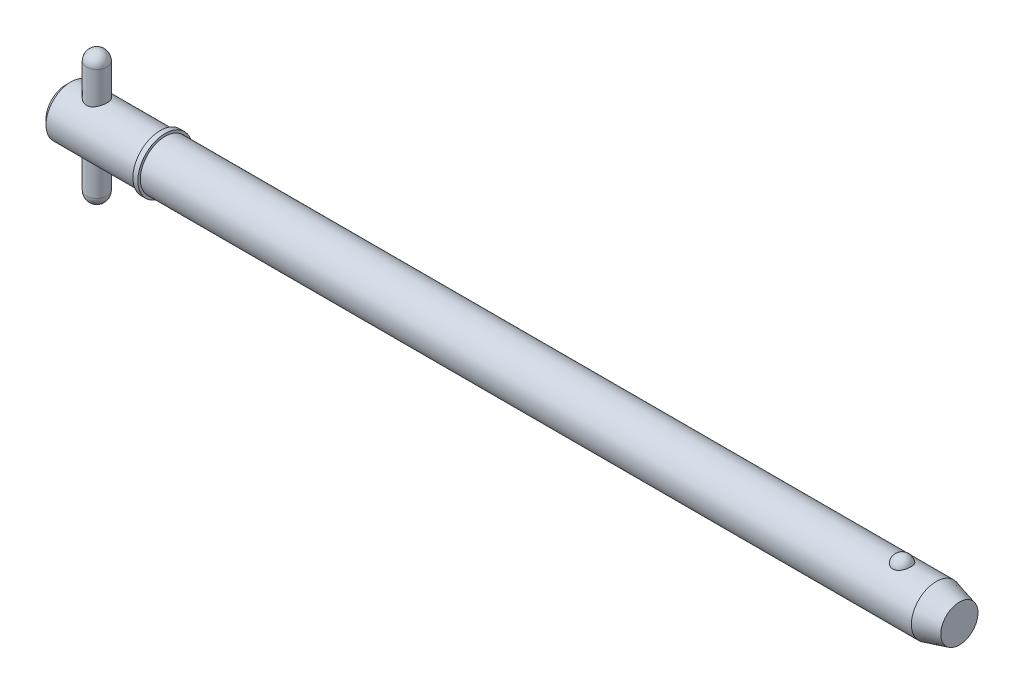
ISO-10303-21;
HEADER;
FILE_DESCRIPTION(('STEP AP214'),'2;1');
FILE_NAME('part.step','',(''),(''),'','','');
FILE_SCHEMA(('AUTOMOTIVE_DESIGN { 1 0 10303 214 1 1 1 1 }'));
ENDSEC;
DATA;
#1=APPLICATION_CONTEXT('core data for automotive mechanical design processes');
#2=APPLICATION_PROTOCOL_DEFINITION('international standard','automotive_design',2000,#1);
#3=PRODUCT_CONTEXT('',#1,'mechanical');
#4=PRODUCT('Part','Part','',(#3));
#5=PRODUCT_RELATED_PRODUCT_CATEGORY('part','',(#4));
#6=PRODUCT_DEFINITION_FORMATION('','',#4);
#7=PRODUCT_DEFINITION_CONTEXT('part definition',#1,'design');
#8=PRODUCT_DEFINITION('design','',#6,#7);
#9=PRODUCT_DEFINITION_SHAPE('','',#8);
#10=(LENGTH_UNIT() NAMED_UNIT(*) SI_UNIT(.MILLI.,.METRE.));
#11=(NAMED_UNIT(*) PLANE_ANGLE_UNIT() SI_UNIT($,.RADIAN.));
#12=(NAMED_UNIT(*) SI_UNIT($,.STERADIAN.) SOLID_ANGLE_UNIT());
#13=UNCERTAINTY_MEASURE_WITH_UNIT(LENGTH_MEASURE(1.E-05),#10,'distance_accuracy_value','');
#14=(GEOMETRIC_REPRESENTATION_CONTEXT(3) GLOBAL_UNCERTAINTY_ASSIGNED_CONTEXT((#13)) GLOBAL_UNIT_ASSIGNED_CONTEXT((#10,
#11,#12)) REPRESENTATION_CONTEXT('',''));
#15=CARTESIAN_POINT('',(0.,0.,0.));
#16=DIRECTION('',(0.,0.,1.));
#17=DIRECTION('',(1.,0.,0.));
#18=AXIS2_PLACEMENT_3D('',#15,#16,#17);
#19=CARTESIAN_POINT('',(5.94,12.7,0.));
#20=DIRECTION('',(0.,-1.,0.));
#21=DIRECTION('',(0.,0.,-1.));
#22=AXIS2_PLACEMENT_3D('',#19,#20,#21);
#23=CYLINDRICAL_SURFACE('',#22,1.98);
#24=CARTESIAN_POINT('',(5.94,-10.72,0.));
#25=DIRECTION('',(0.,-1.,0.));
#26=DIRECTION('',(0.,0.,-1.));
#27=AXIS2_PLACEMENT_3D('',#24,#25,#26);
#28=CIRCLE('',#27,1.98);
#29=CARTESIAN_POINT('',(5.94,-10.72,-1.98));
#30=VERTEX_POINT('',#29);
#31=EDGE_CURVE('P0_E10',#30,#30,#28,.F.);
#32=ORIENTED_EDGE('',*,*,#31,.T.);
#33=EDGE_LOOP('',(#32));
#34=FACE_BOUND('',#33,.T.);
#35=CARTESIAN_POINT('',(5.94,10.72,0.));
#36=DIRECTION('',(0.,-1.,0.));
#37=DIRECTION('',(0.,0.,-1.));
#38=AXIS2_PLACEMENT_3D('',#35,#36,#37);
#39=CIRCLE('',#38,1.98);
#40=CARTESIAN_POINT('',(5.94,10.72,-1.98));
#41=VERTEX_POINT('',#40);
#42=EDGE_CURVE('P0_E21',#41,#41,#39,.T.);
#43=ORIENTED_EDGE('',*,*,#42,.T.);
#44=EDGE_LOOP('',(#43));
#45=FACE_BOUND('',#44,.T.);
#46=ADVANCED_FACE('P0_F14',(#34,#45),#23,.T.);
#47=CARTESIAN_POINT('',(5.94,-10.72,0.));
#48=DIRECTION('',(0.,0.,1.));
#49=DIRECTION('',(1.,0.,0.));
#50=AXIS2_PLACEMENT_3D('',#47,#48,#49);
#51=SPHERICAL_SURFACE('',#50,1.98);
#52=CARTESIAN_POINT('',(5.94,-10.72,0.));
#53=DIRECTION('',(0.,-1.,0.));
#54=DIRECTION('',(0.,0.,-1.));
#55=AXIS2_PLACEMENT_3D('',#52,#53,#54);
#56=SPHERICAL_SURFACE('',#55,1.98);
#57=ORIENTED_EDGE('',*,*,#31,.F.);
#58=EDGE_LOOP('',(#57));
#59=FACE_BOUND('',#58,.T.);
#60=ADVANCED_FACE('P0_F29',(#59),#56,.T.);
#61=CARTESIAN_POINT('',(5.94,10.72,0.));
#62=DIRECTION('',(0.,0.,1.));
#63=DIRECTION('',(1.,0.,0.));
#64=AXIS2_PLACEMENT_3D('',#61,#62,#63);
#65=SPHERICAL_SURFACE('',#64,1.98);
#66=CARTESIAN_POINT('',(5.94,10.72,0.));
#67=DIRECTION('',(0.,-1.,0.));
#68=DIRECTION('',(0.,0.,-1.));
#69=AXIS2_PLACEMENT_3D('',#66,#67,#68);
#70=SPHERICAL_SURFACE('',#69,1.98);
#71=ORIENTED_EDGE('',*,*,#42,.F.);
#72=EDGE_LOOP('',(#71));
#73=FACE_BOUND('',#72,.T.);
#74=ADVANCED_FACE('P0_F16',(#73),#70,.T.);
#75=CLOSED_SHELL('',(#46,#60,#74));
#76=MANIFOLD_SOLID_BREP('P0_B1',#75);
#77=CARTESIAN_POINT('',(0.,0.,0.));
#78=DIRECTION('',(1.,0.,0.));
#79=DIRECTION('',(0.,0.,-1.));
#80=AXIS2_PLACEMENT_3D('',#77,#78,#79);
#81=CYLINDRICAL_SURFACE('',#80,4.765);
#82=CARTESIAN_POINT('',(167.004194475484,0.,0.));
#83=DIRECTION('',(1.,0.,0.));
#84=DIRECTION('',(0.,0.,-1.));
#85=AXIS2_PLACEMENT_3D('',#82,#83,#84);
#86=CIRCLE('',#85,4.765);
#87=CARTESIAN_POINT('',(167.004194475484,0.,-4.765));
#88=VERTEX_POINT('',#87);
#89=EDGE_CURVE('P1_E81',#88,#88,#86,.T.);
#90=ORIENTED_EDGE('',*,*,#89,.F.);
#91=EDGE_LOOP('',(#90));
#92=FACE_BOUND('',#91,.T.);
#93=CARTESIAN_POINT('',(19.05,0.,0.));
#94=DIRECTION('',(1.,0.,0.));
#95=DIRECTION('',(0.,0.,-1.));
#96=AXIS2_PLACEMENT_3D('',#93,#94,#95);
#97=CIRCLE('',#96,4.765);
#98=CARTESIAN_POINT('',(19.05,0.,-4.765));
#99=VERTEX_POINT('',#98);
#100=EDGE_CURVE('P1_E85',#99,#99,#97,.T.);
#101=ORIENTED_EDGE('',*,*,#100,.T.);
#102=EDGE_LOOP('',(#101));
#103=FACE_BOUND('',#102,.T.);
#104=CARTESIAN_POINT('',(160.451020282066,4.42764777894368,1.76101111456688));
#105=CARTESIAN_POINT('',(160.359721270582,4.42764470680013,1.76101422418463));
#106=CARTESIAN_POINT('',(160.268446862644,4.43059091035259,1.75366340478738));
#107=CARTESIAN_POINT('',(160.088615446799,4.44201846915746,1.72451180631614));
#108=CARTESIAN_POINT('',(160.000057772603,4.45049845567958,1.70271460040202));
#109=CARTESIAN_POINT('',(159.828257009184,4.47200516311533,1.64539370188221));
#110=CARTESIAN_POINT('',(159.745006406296,4.48502527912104,1.60988994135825));
#111=CARTESIAN_POINT('',(159.585763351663,4.51419542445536,1.52617873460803));
#112=CARTESIAN_POINT('',(159.509772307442,4.53034605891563,1.47796883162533));
#113=CARTESIAN_POINT('',(159.364744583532,4.56459317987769,1.36860494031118));
#114=CARTESIAN_POINT('',(159.295964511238,4.58273170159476,1.30712420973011));
#115=CARTESIAN_POINT('',(159.169342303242,4.61870302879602,1.17370204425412));
#116=CARTESIAN_POINT('',(159.111502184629,4.63653577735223,1.10175868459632));
#117=CARTESIAN_POINT('',(159.005570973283,4.67090140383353,0.945806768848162));
#118=CARTESIAN_POINT('',(158.958030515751,4.68734068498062,0.861402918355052));
#119=CARTESIAN_POINT('',(158.877081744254,4.71628466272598,0.685442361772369));
#120=CARTESIAN_POINT('',(158.843674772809,4.72878898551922,0.593884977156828));
#121=CARTESIAN_POINT('',(158.791287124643,4.74874061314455,0.404781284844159));
#122=CARTESIAN_POINT('',(158.772517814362,4.75611366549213,0.307168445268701));
#123=CARTESIAN_POINT('',(158.750584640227,4.76475393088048,0.109940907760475));
#124=CARTESIAN_POINT('',(158.747420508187,4.76602124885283,0.0103262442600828));
#125=CARTESIAN_POINT('',(158.756740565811,4.76232928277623,-0.187629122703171));
#126=CARTESIAN_POINT('',(158.769158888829,4.7573962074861,-0.285973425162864));
#127=CARTESIAN_POINT('',(158.809280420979,4.74184975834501,-0.479027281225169));
#128=CARTESIAN_POINT('',(158.836983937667,4.7312362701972,-0.573736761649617));
#129=CARTESIAN_POINT('',(158.907158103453,4.70540026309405,-0.756973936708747));
#130=CARTESIAN_POINT('',(158.949646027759,4.69017235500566,-0.845494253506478));
#131=CARTESIAN_POINT('',(159.048520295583,4.65669867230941,-1.01378033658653));
#132=CARTESIAN_POINT('',(159.104907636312,4.63845268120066,-1.09354547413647));
#133=CARTESIAN_POINT('',(159.230552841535,4.60085438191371,-1.24228523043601));
#134=CARTESIAN_POINT('',(159.299843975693,4.58149930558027,-1.31123108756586));
#135=CARTESIAN_POINT('',(159.449606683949,4.54391653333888,-1.43607409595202));
#136=CARTESIAN_POINT('',(159.530077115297,4.52568872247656,-1.49197257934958));
#137=CARTESIAN_POINT('',(159.698150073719,4.49293007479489,-1.58786764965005));
#138=CARTESIAN_POINT('',(159.785544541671,4.47832346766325,-1.62820219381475));
#139=CARTESIAN_POINT('',(159.966553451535,4.45406011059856,-1.69345757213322));
#140=CARTESIAN_POINT('',(160.06016555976,4.44440151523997,-1.71838415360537));
#141=CARTESIAN_POINT('',(160.245893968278,4.43159888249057,-1.75112843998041));
#142=CARTESIAN_POINT('',(160.337849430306,4.42815213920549,-1.75974223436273));
#143=CARTESIAN_POINT('',(160.521965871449,4.427247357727,-1.76201865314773));
#144=CARTESIAN_POINT('',(160.614126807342,4.42978816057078,-1.7556841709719));
#145=CARTESIAN_POINT('',(160.793129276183,4.44038648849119,-1.72869560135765));
#146=CARTESIAN_POINT('',(160.880047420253,4.44827555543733,-1.70847853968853));
#147=CARTESIAN_POINT('',(161.049131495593,4.46852246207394,-1.65479562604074));
#148=CARTESIAN_POINT('',(161.131297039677,4.48088066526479,-1.62132869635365));
#149=CARTESIAN_POINT('',(161.290591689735,4.50907357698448,-1.54120560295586));
#150=CARTESIAN_POINT('',(161.367570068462,4.52497884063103,-1.49427526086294));
#151=CARTESIAN_POINT('',(161.512708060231,4.55845148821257,-1.38881222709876));
#152=CARTESIAN_POINT('',(161.580865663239,4.57601924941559,-1.33027689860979));
#153=CARTESIAN_POINT('',(161.710099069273,4.61196537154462,-1.1999104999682));
#154=CARTESIAN_POINT('',(161.770656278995,4.63034074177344,-1.12756415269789));
#155=CARTESIAN_POINT('',(161.879279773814,4.66513959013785,-0.97361299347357));
#156=CARTESIAN_POINT('',(161.927343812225,4.68156271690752,-0.892006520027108));
#157=CARTESIAN_POINT('',(162.011383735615,4.71130224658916,-0.718892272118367));
#158=CARTESIAN_POINT('',(162.046918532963,4.724501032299,-0.627149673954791));
#159=CARTESIAN_POINT('',(162.102952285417,4.74571823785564,-0.438611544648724));
#160=CARTESIAN_POINT('',(162.123450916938,4.75373654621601,-0.34181590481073));
#161=CARTESIAN_POINT('',(162.149033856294,4.76378905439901,-0.14563306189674));
#162=CARTESIAN_POINT('',(162.154076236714,4.76580697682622,-0.0462395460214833));
#163=CARTESIAN_POINT('',(162.148523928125,4.7636057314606,0.152038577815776));
#164=CARTESIAN_POINT('',(162.137929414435,4.75938663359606,0.250923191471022));
#165=CARTESIAN_POINT('',(162.101387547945,4.74516937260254,0.445004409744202));
#166=CARTESIAN_POINT('',(162.075496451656,4.73519238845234,0.540213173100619));
#167=CARTESIAN_POINT('',(162.008927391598,4.71049394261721,0.724662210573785));
#168=CARTESIAN_POINT('',(161.968248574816,4.69577220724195,0.813902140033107));
#169=CARTESIAN_POINT('',(161.872717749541,4.66303767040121,0.984313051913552));
#170=CARTESIAN_POINT('',(161.817804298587,4.64501070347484,1.06544688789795));
#171=CARTESIAN_POINT('',(161.695049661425,4.60764678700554,1.21692673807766));
#172=CARTESIAN_POINT('',(161.627208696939,4.58830985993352,1.28727293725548));
#173=CARTESIAN_POINT('',(161.480548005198,4.55060370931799,1.41479271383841));
#174=CARTESIAN_POINT('',(161.401791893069,4.53222967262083,1.47203785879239));
#175=CARTESIAN_POINT('',(161.234989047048,4.49849576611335,1.57212016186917));
#176=CARTESIAN_POINT('',(161.146941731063,4.48313608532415,1.6149564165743));
#177=CARTESIAN_POINT('',(160.959791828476,4.45676184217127,1.68642657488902));
#178=CARTESIAN_POINT('',(160.860365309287,4.44598302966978,1.71430590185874));
#179=CARTESIAN_POINT('',(160.657621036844,4.43142918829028,1.7515925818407));
#180=CARTESIAN_POINT('',(160.554304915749,4.42765125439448,1.76100759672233));
#181=CARTESIAN_POINT('',(160.451020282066,4.42764777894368,1.76101111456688));
#182=B_SPLINE_CURVE_WITH_KNOTS('',3,(#104,#105,#106,#107,#108,#109,#110,#111,#112,#113,#114,
#115,#116,#117,#118,#119,#120,#121,#122,#123,#124,#125,#126,#127,#128,#129,#130,#131,#132,#133,
#134,#135,#136,#137,#138,#139,#140,#141,#142,#143,#144,#145,#146,#147,#148,#149,#150,#151,#152,
#153,#154,#155,#156,#157,#158,#159,#160,#161,#162,#163,#164,#165,#166,#167,#168,#169,#170,#171,
#172,#173,#174,#175,#176,#177,#178,#179,#180,#181),.UNSPECIFIED.,.T.,.F.,(4,2,2,2,2,2,2,2,2,2,2,
2,2,2,2,2,2,2,2,2,2,2,2,2,2,2,2,2,2,2,2,2,2,2,2,2,2,2,4),(0.,0.273517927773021,
0.546968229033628,0.820022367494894,1.09312934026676,1.37393946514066,1.6548013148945,
1.94820420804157,2.24163496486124,2.53922817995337,2.83681628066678,3.13315071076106,
3.42949110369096,3.72617893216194,4.02288805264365,4.32037303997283,4.61782764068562,
4.90840095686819,5.19886582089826,5.47474855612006,5.75057789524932,6.0180997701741,
6.28564340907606,6.55907787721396,6.83257454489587,7.11962987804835,7.40673679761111,
7.70312663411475,7.9995228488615,8.29672237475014,8.59391856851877,8.89002850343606,
9.18615552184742,9.48358266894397,9.7810047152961,10.0767610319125,10.3725358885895,
10.6820893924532,10.991514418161),.UNSPECIFIED.);
#183=CARTESIAN_POINT('',(160.451020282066,4.42764777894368,1.76101111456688));
#184=VERTEX_POINT('',#183);
#185=EDGE_CURVE('P1_E35',#184,#184,#182,.T.);
#186=ORIENTED_EDGE('',*,*,#185,.T.);
#187=EDGE_LOOP('',(#186));
#188=FACE_BOUND('',#187,.T.);
#189=ADVANCED_FACE('P1_F13',(#92,#103,#188),#81,.T.);
#190=CARTESIAN_POINT('',(0.,0.,0.));
#191=DIRECTION('',(-1.,0.,0.));
#192=DIRECTION('',(0.,0.,1.));
#193=AXIS2_PLACEMENT_3D('',#190,#191,#192);
#194=PLANE('',#193);
#195=CARTESIAN_POINT('',(0.,0.,0.));
#196=DIRECTION('',(1.,0.,0.));
#197=DIRECTION('',(0.,0.,-1.));
#198=AXIS2_PLACEMENT_3D('',#195,#196,#197);
#199=CIRCLE('',#198,3.812);
#200=CARTESIAN_POINT('',(0.,0.,-3.812));
#201=VERTEX_POINT('',#200);
#202=EDGE_CURVE('P1_E9',#201,#201,#199,.T.);
#203=ORIENTED_EDGE('',*,*,#202,.F.);
#204=EDGE_LOOP('',(#203));
#205=FACE_BOUND('',#204,.T.);
#206=ADVANCED_FACE('P1_F15',(#205),#194,.T.);
#207=CARTESIAN_POINT('',(0.952999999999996,0.,0.));
#208=DIRECTION('',(1.,0.,0.));
#209=DIRECTION('',(0.,0.,-1.));
#210=AXIS2_PLACEMENT_3D('',#207,#208,#209);
#211=CONICAL_SURFACE('',#210,4.765,0.78539816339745);
#212=ORIENTED_EDGE('',*,*,#202,.T.);
#213=EDGE_LOOP('',(#212));
#214=FACE_BOUND('',#213,.T.);
#215=CARTESIAN_POINT('',(0.952999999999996,0.,0.));
#216=DIRECTION('',(1.,0.,0.));
#217=DIRECTION('',(0.,0.,-1.));
#218=AXIS2_PLACEMENT_3D('',#215,#216,#217);
#219=CIRCLE('',#218,4.765);
#220=CARTESIAN_POINT('',(0.952999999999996,0.,-4.765));
#221=VERTEX_POINT('',#220);
#222=EDGE_CURVE('P1_E26',#221,#221,#219,.T.);
#223=ORIENTED_EDGE('',*,*,#222,.F.);
#224=EDGE_LOOP('',(#223));
#225=FACE_BOUND('',#224,.T.);
#226=ADVANCED_FACE('P1_F77',(#214,#225),#211,.T.);
#227=CARTESIAN_POINT('',(0.,0.,0.));
#228=DIRECTION('',(1.,0.,0.));
#229=DIRECTION('',(0.,0.,-1.));
#230=AXIS2_PLACEMENT_3D('',#227,#228,#229);
#231=CYLINDRICAL_SURFACE('',#230,4.765);
#232=CARTESIAN_POINT('',(5.94,-4.33414639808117,1.98));
#233=CARTESIAN_POINT('',(5.83435484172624,-4.33415447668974,1.97999169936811));
#234=CARTESIAN_POINT('',(5.72854887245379,-4.33806396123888,1.97149330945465));
#235=CARTESIAN_POINT('',(5.51998191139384,-4.35319906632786,1.93783487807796));
#236=CARTESIAN_POINT('',(5.41723000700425,-4.3644446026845,1.91262947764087));
#237=CARTESIAN_POINT('',(5.21817294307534,-4.39274225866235,1.84670269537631));
#238=CARTESIAN_POINT('',(5.12184344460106,-4.40977076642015,1.80604432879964));
#239=CARTESIAN_POINT('',(4.93740039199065,-4.44768106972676,1.71055160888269));
#240=CARTESIAN_POINT('',(4.84928487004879,-4.46856193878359,1.65572066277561));
#241=CARTESIAN_POINT('',(4.67826533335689,-4.51326966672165,1.52981120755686));
#242=CARTESIAN_POINT('',(4.59593118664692,-4.53719608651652,1.45799365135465));
#243=CARTESIAN_POINT('',(4.44405452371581,-4.58448035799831,1.30170177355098));
#244=CARTESIAN_POINT('',(4.37451692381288,-4.60783798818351,1.21722260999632));
#245=CARTESIAN_POINT('',(4.24730683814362,-4.65256187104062,1.03353484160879));
#246=CARTESIAN_POINT('',(4.19027484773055,-4.67379892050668,0.933848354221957));
#247=CARTESIAN_POINT('',(4.0940363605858,-4.7106711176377,0.7252544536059));
#248=CARTESIAN_POINT('',(4.05482199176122,-4.72630873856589,0.61635113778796));
#249=CARTESIAN_POINT('',(3.99739515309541,-4.74951416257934,0.398397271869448));
#250=CARTESIAN_POINT('',(3.97820018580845,-4.7574579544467,0.289646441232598));
#251=CARTESIAN_POINT('',(3.95818309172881,-4.76574596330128,0.0701967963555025));
#252=CARTESIAN_POINT('',(3.95735355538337,-4.76609324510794,-0.0405012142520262));
#253=CARTESIAN_POINT('',(3.9735743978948,-4.75937098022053,-0.253561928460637));
#254=CARTESIAN_POINT('',(3.98954548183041,-4.75274912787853,-0.356023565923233));
#255=CARTESIAN_POINT('',(4.03706504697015,-4.73344665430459,-0.556659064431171));
#256=CARTESIAN_POINT('',(4.06861467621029,-4.72076558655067,-0.654832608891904));
#257=CARTESIAN_POINT('',(4.14677192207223,-4.69032846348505,-0.845904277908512));
#258=CARTESIAN_POINT('',(4.19360181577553,-4.67249797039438,-0.938699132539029));
#259=CARTESIAN_POINT('',(4.30077315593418,-4.63350852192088,-1.11535616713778));
#260=CARTESIAN_POINT('',(4.3611193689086,-4.61234839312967,-1.19921518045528));
#261=CARTESIAN_POINT('',(4.49853487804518,-4.56707259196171,-1.3618711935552));
#262=CARTESIAN_POINT('',(4.57648039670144,-4.5428537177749,-1.43990029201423));
#263=CARTESIAN_POINT('',(4.74440779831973,-4.49530722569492,-1.58211009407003));
#264=CARTESIAN_POINT('',(4.83439425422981,-4.47197995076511,-1.64628551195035));
#265=CARTESIAN_POINT('',(5.02755026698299,-4.42812342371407,-1.76092221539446));
#266=CARTESIAN_POINT('',(5.13105348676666,-4.40770990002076,-1.81086937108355));
#267=CARTESIAN_POINT('',(5.34607555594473,-4.37336901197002,-1.89231211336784));
#268=CARTESIAN_POINT('',(5.45758864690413,-4.3594370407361,-1.92382080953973));
#269=CARTESIAN_POINT('',(5.67777275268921,-4.34077746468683,-1.96554536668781));
#270=CARTESIAN_POINT('',(5.78616167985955,-4.33551319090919,-1.9770057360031));
#271=CARTESIAN_POINT('',(6.00341835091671,-4.33325118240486,-1.98196183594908));
#272=CARTESIAN_POINT('',(6.11228591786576,-4.33625061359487,-1.97546372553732));
#273=CARTESIAN_POINT('',(6.32012423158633,-4.34962383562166,-1.94582288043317));
#274=CARTESIAN_POINT('',(6.41928436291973,-4.35951709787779,-1.92376364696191));
#275=CARTESIAN_POINT('',(6.61241543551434,-4.38495043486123,-1.86506038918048));
#276=CARTESIAN_POINT('',(6.70638516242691,-4.40049182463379,-1.82841296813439));
#277=CARTESIAN_POINT('',(6.89090272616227,-4.43627016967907,-1.73985559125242));
#278=CARTESIAN_POINT('',(6.98113841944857,-4.45667771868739,-1.68736639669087));
#279=CARTESIAN_POINT('',(7.1519532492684,-4.49964530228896,-1.56919282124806));
#280=CARTESIAN_POINT('',(7.232528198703,-4.52220626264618,-1.50350275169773));
#281=CARTESIAN_POINT('',(7.38851617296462,-4.56914071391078,-1.35452895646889));
#282=CARTESIAN_POINT('',(7.46298462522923,-4.5935132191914,-1.27025197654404));
#283=CARTESIAN_POINT('',(7.59689029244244,-4.63962841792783,-1.08983181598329));
#284=CARTESIAN_POINT('',(7.65632644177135,-4.66137092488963,-0.993687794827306));
#285=CARTESIAN_POINT('',(7.75840361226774,-4.69991192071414,-0.791608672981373));
#286=CARTESIAN_POINT('',(7.80100481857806,-4.71669866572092,-0.685651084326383));
#287=CARTESIAN_POINT('',(7.86746997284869,-4.74331408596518,-0.467197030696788));
#288=CARTESIAN_POINT('',(7.8913450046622,-4.75314687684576,-0.354704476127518));
#289=CARTESIAN_POINT('',(7.91828971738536,-4.76427543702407,-0.134819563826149));
#290=CARTESIAN_POINT('',(7.92269147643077,-4.76611762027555,-0.027616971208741));
#291=CARTESIAN_POINT('',(7.91414154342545,-4.76256684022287,0.185959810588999));
#292=CARTESIAN_POINT('',(7.90119286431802,-4.75717513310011,0.292334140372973));
#293=CARTESIAN_POINT('',(7.85926572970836,-4.74004856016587,0.497383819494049));
#294=CARTESIAN_POINT('',(7.83086647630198,-4.72854322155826,0.596198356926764));
#295=CARTESIAN_POINT('',(7.75947503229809,-4.70045111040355,0.787624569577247));
#296=CARTESIAN_POINT('',(7.71648006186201,-4.68386336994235,0.880235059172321));
#297=CARTESIAN_POINT('',(7.6149456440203,-4.64628321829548,1.06122875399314));
#298=CARTESIAN_POINT('',(7.55579211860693,-4.62512577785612,1.14923242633));
#299=CARTESIAN_POINT('',(7.42451813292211,-4.58091700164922,1.31443888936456));
#300=CARTESIAN_POINT('',(7.35239289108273,-4.5578649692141,1.39163767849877));
#301=CARTESIAN_POINT('',(7.19146107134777,-4.51050832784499,1.53847013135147));
#302=CARTESIAN_POINT('',(7.10185635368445,-4.48622440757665,1.60723941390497));
#303=CARTESIAN_POINT('',(6.91164948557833,-4.44076541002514,1.72888900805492));
#304=CARTESIAN_POINT('',(6.81104124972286,-4.41959206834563,1.78176046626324));
#305=CARTESIAN_POINT('',(6.60181953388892,-4.38318936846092,1.86953227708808));
#306=CARTESIAN_POINT('',(6.49325511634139,-4.3679267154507,1.90453365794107));
#307=CARTESIAN_POINT('',(6.32681512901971,-4.35102038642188,1.94268459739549));
#308=CARTESIAN_POINT('',(6.27079191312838,-4.34638447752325,1.953006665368));
#309=CARTESIAN_POINT('',(6.15793999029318,-4.33925923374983,1.96879053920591));
#310=CARTESIAN_POINT('',(6.10111188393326,-4.33676837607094,1.97425579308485));
#311=CARTESIAN_POINT('',(6.00947316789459,-4.33456308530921,1.97908711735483));
#312=CARTESIAN_POINT('',(5.97474528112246,-4.33414374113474,1.98000272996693));
#313=CARTESIAN_POINT('',(5.94,-4.33414639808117,1.98));
#314=B_SPLINE_CURVE_WITH_KNOTS('',3,(#232,#233,#234,#235,#236,#237,#238,#239,#240,#241,#242,
#243,#244,#245,#246,#247,#248,#249,#250,#251,#252,#253,#254,#255,#256,#257,#258,#259,#260,#261,
#262,#263,#264,#265,#266,#267,#268,#269,#270,#271,#272,#273,#274,#275,#276,#277,#278,#279,#280,
#281,#282,#283,#284,#285,#286,#287,#288,#289,#290,#291,#292,#293,#294,#295,#296,#297,#298,#299,
#300,#301,#302,#303,#304,#305,#306,#307,#308,#309,#310,#311,#312,#313),.UNSPECIFIED.,.T.,.F.,(4,
2,2,2,2,2,2,2,2,2,2,2,2,2,2,2,2,2,2,2,2,2,2,2,2,2,2,2,2,2,2,2,2,2,2,2,2,2,2,2,4),(0.,
0.316814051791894,0.634491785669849,0.950887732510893,1.2672076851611,1.60127705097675,
1.93547449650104,2.28407463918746,2.63252061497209,2.96292077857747,3.29318763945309,
3.60346227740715,3.91375978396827,4.22878888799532,4.54392926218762,4.88117914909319,
5.21855748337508,5.56691259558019,5.91501972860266,6.24062939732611,6.56612741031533,
6.87094948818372,7.17584258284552,7.49361276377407,7.81152017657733,8.15513975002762,
8.4987836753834,8.8432355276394,9.18748334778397,9.50777781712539,9.8280166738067,
10.1370037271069,10.4460496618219,10.7690461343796,11.0921619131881,11.4371238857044,
11.7822776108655,12.1254577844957,12.2967183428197,12.4678572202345,12.5720531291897),.UNSPECIFIED.);
#315=CARTESIAN_POINT('',(5.94,-4.33414639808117,1.98));
#316=VERTEX_POINT('',#315);
#317=EDGE_CURVE('P1_E17',#316,#316,#314,.T.);
#318=ORIENTED_EDGE('',*,*,#317,.F.);
#319=EDGE_LOOP('',(#318));
#320=FACE_BOUND('',#319,.T.);
#321=CARTESIAN_POINT('',(5.94,4.33414639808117,1.98));
#322=CARTESIAN_POINT('',(6.04564515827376,4.33415447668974,1.97999169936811));
#323=CARTESIAN_POINT('',(6.15145112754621,4.33806396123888,1.97149330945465));
#324=CARTESIAN_POINT('',(6.36001808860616,4.35319906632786,1.93783487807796));
#325=CARTESIAN_POINT('',(6.46276999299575,4.3644446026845,1.91262947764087));
#326=CARTESIAN_POINT('',(6.66182705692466,4.39274225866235,1.84670269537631));
#327=CARTESIAN_POINT('',(6.75815655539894,4.40977076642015,1.80604432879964));
#328=CARTESIAN_POINT('',(6.94259960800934,4.44768106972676,1.71055160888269));
#329=CARTESIAN_POINT('',(7.03071512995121,4.46856193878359,1.65572066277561));
#330=CARTESIAN_POINT('',(7.20173466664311,4.51326966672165,1.52981120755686));
#331=CARTESIAN_POINT('',(7.28406881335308,4.53719608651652,1.45799365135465));
#332=CARTESIAN_POINT('',(7.43594547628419,4.58448035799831,1.30170177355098));
#333=CARTESIAN_POINT('',(7.50548307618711,4.60783798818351,1.21722260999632));
#334=CARTESIAN_POINT('',(7.63269316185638,4.65256187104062,1.03353484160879));
#335=CARTESIAN_POINT('',(7.68972515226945,4.67379892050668,0.933848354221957));
#336=CARTESIAN_POINT('',(7.7859636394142,4.7106711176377,0.7252544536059));
#337=CARTESIAN_POINT('',(7.82517800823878,4.72630873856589,0.61635113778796));
#338=CARTESIAN_POINT('',(7.88260484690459,4.74951416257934,0.398397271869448));
#339=CARTESIAN_POINT('',(7.90179981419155,4.7574579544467,0.289646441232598));
#340=CARTESIAN_POINT('',(7.92181690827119,4.76574596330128,0.0701967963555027));
#341=CARTESIAN_POINT('',(7.92264644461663,4.76609324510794,-0.040501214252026));
#342=CARTESIAN_POINT('',(7.9064256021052,4.75937098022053,-0.253561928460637));
#343=CARTESIAN_POINT('',(7.89045451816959,4.75274912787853,-0.356023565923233));
#344=CARTESIAN_POINT('',(7.84293495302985,4.73344665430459,-0.55665906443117));
#345=CARTESIAN_POINT('',(7.81138532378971,4.72076558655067,-0.654832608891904));
#346=CARTESIAN_POINT('',(7.73322807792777,4.69032846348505,-0.845904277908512));
#347=CARTESIAN_POINT('',(7.68639818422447,4.67249797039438,-0.938699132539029));
#348=CARTESIAN_POINT('',(7.57922684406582,4.63350852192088,-1.11535616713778));
#349=CARTESIAN_POINT('',(7.5188806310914,4.61234839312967,-1.19921518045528));
#350=CARTESIAN_POINT('',(7.38146512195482,4.56707259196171,-1.3618711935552));
#351=CARTESIAN_POINT('',(7.30351960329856,4.5428537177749,-1.43990029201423));
#352=CARTESIAN_POINT('',(7.13559220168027,4.49530722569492,-1.58211009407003));
#353=CARTESIAN_POINT('',(7.04560574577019,4.47197995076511,-1.64628551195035));
#354=CARTESIAN_POINT('',(6.85244973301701,4.42812342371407,-1.76092221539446));
#355=CARTESIAN_POINT('',(6.74894651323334,4.40770990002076,-1.81086937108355));
#356=CARTESIAN_POINT('',(6.53392444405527,4.37336901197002,-1.89231211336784));
#357=CARTESIAN_POINT('',(6.42241135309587,4.3594370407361,-1.92382080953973));
#358=CARTESIAN_POINT('',(6.20222724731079,4.34077746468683,-1.96554536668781));
#359=CARTESIAN_POINT('',(6.09383832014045,4.33551319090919,-1.9770057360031));
#360=CARTESIAN_POINT('',(5.87658164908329,4.33325118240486,-1.98196183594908));
#361=CARTESIAN_POINT('',(5.76771408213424,4.33625061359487,-1.97546372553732));
#362=CARTESIAN_POINT('',(5.55987576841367,4.34962383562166,-1.94582288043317));
#363=CARTESIAN_POINT('',(5.46071563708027,4.35951709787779,-1.92376364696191));
#364=CARTESIAN_POINT('',(5.26758456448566,4.38495043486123,-1.86506038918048));
#365=CARTESIAN_POINT('',(5.17361483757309,4.40049182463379,-1.82841296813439));
#366=CARTESIAN_POINT('',(4.98909727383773,4.43627016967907,-1.73985559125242));
#367=CARTESIAN_POINT('',(4.89886158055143,4.45667771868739,-1.68736639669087));
#368=CARTESIAN_POINT('',(4.72804675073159,4.49964530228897,-1.56919282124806));
#369=CARTESIAN_POINT('',(4.647471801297,4.52220626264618,-1.50350275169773));
#370=CARTESIAN_POINT('',(4.49148382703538,4.56914071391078,-1.35452895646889));
#371=CARTESIAN_POINT('',(4.41701537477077,4.5935132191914,-1.27025197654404));
#372=CARTESIAN_POINT('',(4.28310970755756,4.63962841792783,-1.08983181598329));
#373=CARTESIAN_POINT('',(4.22367355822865,4.66137092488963,-0.993687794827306));
#374=CARTESIAN_POINT('',(4.12159638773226,4.69991192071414,-0.791608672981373));
#375=CARTESIAN_POINT('',(4.07899518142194,4.71669866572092,-0.685651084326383));
#376=CARTESIAN_POINT('',(4.01253002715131,4.74331408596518,-0.467197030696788));
#377=CARTESIAN_POINT('',(3.98865499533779,4.75314687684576,-0.354704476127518));
#378=CARTESIAN_POINT('',(3.96171028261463,4.76427543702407,-0.134819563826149));
#379=CARTESIAN_POINT('',(3.95730852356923,4.76611762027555,-0.0276169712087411));
#380=CARTESIAN_POINT('',(3.96585845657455,4.76256684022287,0.185959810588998));
#381=CARTESIAN_POINT('',(3.97880713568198,4.75717513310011,0.292334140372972));
#382=CARTESIAN_POINT('',(4.02073427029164,4.74004856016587,0.497383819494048));
#383=CARTESIAN_POINT('',(4.04913352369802,4.72854322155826,0.596198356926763));
#384=CARTESIAN_POINT('',(4.12052496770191,4.70045111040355,0.787624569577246));
#385=CARTESIAN_POINT('',(4.16351993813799,4.68386336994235,0.880235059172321));
#386=CARTESIAN_POINT('',(4.2650543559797,4.64628321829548,1.06122875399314));
#387=CARTESIAN_POINT('',(4.32420788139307,4.62512577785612,1.14923242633));
#388=CARTESIAN_POINT('',(4.45548186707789,4.58091700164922,1.31443888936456));
#389=CARTESIAN_POINT('',(4.52760710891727,4.5578649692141,1.39163767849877));
#390=CARTESIAN_POINT('',(4.68853892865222,4.51050832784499,1.53847013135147));
#391=CARTESIAN_POINT('',(4.77814364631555,4.48622440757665,1.60723941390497));
#392=CARTESIAN_POINT('',(4.96835051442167,4.44076541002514,1.72888900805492));
#393=CARTESIAN_POINT('',(5.06895875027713,4.41959206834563,1.78176046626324));
#394=CARTESIAN_POINT('',(5.27818046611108,4.38318936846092,1.86953227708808));
#395=CARTESIAN_POINT('',(5.38674488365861,4.3679267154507,1.90453365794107));
#396=CARTESIAN_POINT('',(5.55318487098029,4.35102038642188,1.94268459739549));
#397=CARTESIAN_POINT('',(5.60920808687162,4.34638447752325,1.953006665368));
#398=CARTESIAN_POINT('',(5.72206000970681,4.33925923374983,1.96879053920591));
#399=CARTESIAN_POINT('',(5.77888811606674,4.33676837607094,1.97425579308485));
#400=CARTESIAN_POINT('',(5.87052683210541,4.33456308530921,1.97908711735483));
#401=CARTESIAN_POINT('',(5.90525471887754,4.33414374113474,1.98000272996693));
#402=CARTESIAN_POINT('',(5.94,4.33414639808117,1.98));
#403=B_SPLINE_CURVE_WITH_KNOTS('',3,(#321,#322,#323,#324,#325,#326,#327,#328,#329,#330,#331,
#332,#333,#334,#335,#336,#337,#338,#339,#340,#341,#342,#343,#344,#345,#346,#347,#348,#349,#350,
#351,#352,#353,#354,#355,#356,#357,#358,#359,#360,#361,#362,#363,#364,#365,#366,#367,#368,#369,
#370,#371,#372,#373,#374,#375,#376,#377,#378,#379,#380,#381,#382,#383,#384,#385,#386,#387,#388,
#389,#390,#391,#392,#393,#394,#395,#396,#397,#398,#399,#400,#401,#402),.UNSPECIFIED.,.T.,.F.,(4,
2,2,2,2,2,2,2,2,2,2,2,2,2,2,2,2,2,2,2,2,2,2,2,2,2,2,2,2,2,2,2,2,2,2,2,2,2,2,2,4),(0.,
0.316814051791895,0.634491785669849,0.950887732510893,1.2672076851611,1.60127705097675,
1.93547449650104,2.28407463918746,2.63252061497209,2.96292077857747,3.29318763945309,
3.60346227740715,3.91375978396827,4.22878888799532,4.54392926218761,4.88117914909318,
5.21855748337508,5.56691259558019,5.91501972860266,6.24062939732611,6.56612741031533,
6.87094948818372,7.17584258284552,7.49361276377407,7.81152017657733,8.15513975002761,
8.4987836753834,8.84323552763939,9.18748334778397,9.50777781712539,9.8280166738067,
10.1370037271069,10.4460496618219,10.7690461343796,11.0921619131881,11.4371238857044,
11.7822776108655,12.1254577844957,12.2967183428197,12.4678572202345,12.5720531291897),.UNSPECIFIED.);
#404=CARTESIAN_POINT('',(5.94,4.33414639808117,1.98));
#405=VERTEX_POINT('',#404);
#406=EDGE_CURVE('P1_E43',#405,#405,#403,.T.);
#407=ORIENTED_EDGE('',*,*,#406,.F.);
#408=EDGE_LOOP('',(#407));
#409=FACE_BOUND('',#408,.T.);
#410=ORIENTED_EDGE('',*,*,#222,.T.);
#411=EDGE_LOOP('',(#410));
#412=FACE_BOUND('',#411,.T.);
#413=CARTESIAN_POINT('',(18.097,0.,0.));
#414=DIRECTION('',(1.,0.,0.));
#415=DIRECTION('',(0.,0.,-1.));
#416=AXIS2_PLACEMENT_3D('',#413,#414,#415);
#417=CIRCLE('',#416,4.765);
#418=CARTESIAN_POINT('',(18.097,0.,-4.765));
#419=VERTEX_POINT('',#418);
#420=EDGE_CURVE('P1_E31',#419,#419,#417,.T.);
#421=ORIENTED_EDGE('',*,*,#420,.F.);
#422=EDGE_LOOP('',(#421));
#423=FACE_BOUND('',#422,.T.);
#424=ADVANCED_FACE('P1_F103',(#320,#409,#412,#423),#231,.T.);
#425=CARTESIAN_POINT('',(18.097,4.765,0.));
#426=DIRECTION('',(-1.,0.,0.));
#427=DIRECTION('',(0.,0.,1.));
#428=AXIS2_PLACEMENT_3D('',#425,#426,#427);
#429=PLANE('',#428);
#430=ORIENTED_EDGE('',*,*,#420,.T.);
#431=EDGE_LOOP('',(#430));
#432=FACE_BOUND('',#431,.T.);
#433=CARTESIAN_POINT('',(18.097,0.,0.));
#434=DIRECTION('',(1.,0.,0.));
#435=DIRECTION('',(0.,0.,-1.));
#436=AXIS2_PLACEMENT_3D('',#433,#434,#435);
#437=CIRCLE('',#436,5.2415);
#438=CARTESIAN_POINT('',(18.097,0.,-5.2415));
#439=VERTEX_POINT('',#438);
#440=EDGE_CURVE('P1_E91',#439,#439,#437,.T.);
#441=ORIENTED_EDGE('',*,*,#440,.F.);
#442=EDGE_LOOP('',(#441));
#443=FACE_BOUND('',#442,.T.);
#444=ADVANCED_FACE('P1_F100',(#432,#443),#429,.T.);
#445=CARTESIAN_POINT('',(0.,0.,0.));
#446=DIRECTION('',(1.,0.,0.));
#447=DIRECTION('',(0.,0.,-1.));
#448=AXIS2_PLACEMENT_3D('',#445,#446,#447);
#449=CYLINDRICAL_SURFACE('',#448,5.2415);
#450=ORIENTED_EDGE('',*,*,#440,.T.);
#451=EDGE_LOOP('',(#450));
#452=FACE_BOUND('',#451,.T.);
#453=CARTESIAN_POINT('',(19.05,0.,0.));
#454=DIRECTION('',(1.,0.,0.));
#455=DIRECTION('',(0.,0.,-1.));
#456=AXIS2_PLACEMENT_3D('',#453,#454,#455);
#457=CIRCLE('',#456,5.2415);
#458=CARTESIAN_POINT('',(19.05,0.,-5.2415));
#459=VERTEX_POINT('',#458);
#460=EDGE_CURVE('P1_E88',#459,#459,#457,.T.);
#461=ORIENTED_EDGE('',*,*,#460,.F.);
#462=EDGE_LOOP('',(#461));
#463=FACE_BOUND('',#462,.T.);
#464=ADVANCED_FACE('P1_F68',(#452,#463),#449,.T.);
#465=CARTESIAN_POINT('',(19.05,5.2415,0.));
#466=DIRECTION('',(1.,0.,0.));
#467=DIRECTION('',(0.,0.,-1.));
#468=AXIS2_PLACEMENT_3D('',#465,#466,#467);
#469=PLANE('',#468);
#470=ORIENTED_EDGE('',*,*,#460,.T.);
#471=EDGE_LOOP('',(#470));
#472=FACE_BOUND('',#471,.T.);
#473=ORIENTED_EDGE('',*,*,#100,.F.);
#474=EDGE_LOOP('',(#473));
#475=FACE_BOUND('',#474,.T.);
#476=ADVANCED_FACE('P1_F62',(#472,#475),#469,.T.);
#477=CARTESIAN_POINT('',(171.45,0.,0.));
#478=DIRECTION('',(-1.,0.,0.));
#479=DIRECTION('',(0.,0.,1.));
#480=AXIS2_PLACEMENT_3D('',#477,#478,#479);
#481=CONICAL_SURFACE('',#480,3.57375000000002,0.26179938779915);
#482=ORIENTED_EDGE('',*,*,#89,.T.);
#483=EDGE_LOOP('',(#482));
#484=FACE_BOUND('',#483,.T.);
#485=CARTESIAN_POINT('',(171.45,0.,0.));
#486=DIRECTION('',(1.,0.,0.));
#487=DIRECTION('',(0.,0.,-1.));
#488=AXIS2_PLACEMENT_3D('',#485,#486,#487);
#489=CIRCLE('',#488,3.57375000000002);
#490=CARTESIAN_POINT('',(171.45,0.,-3.57375000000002));
#491=VERTEX_POINT('',#490);
#492=EDGE_CURVE('P1_E42',#491,#491,#489,.T.);
#493=ORIENTED_EDGE('',*,*,#492,.F.);
#494=EDGE_LOOP('',(#493));
#495=FACE_BOUND('',#494,.T.);
#496=ADVANCED_FACE('P1_F59',(#484,#495),#481,.T.);
#497=CARTESIAN_POINT('',(171.45,3.57375000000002,0.));
#498=DIRECTION('',(1.,0.,0.));
#499=DIRECTION('',(0.,0.,-1.));
#500=AXIS2_PLACEMENT_3D('',#497,#498,#499);
#501=PLANE('',#500);
#502=ORIENTED_EDGE('',*,*,#492,.T.);
#503=EDGE_LOOP('',(#502));
#504=FACE_BOUND('',#503,.T.);
#505=ADVANCED_FACE('P1_F55',(#504),#501,.T.);
#506=CARTESIAN_POINT('',(160.451020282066,4.2885,0.));
#507=DIRECTION('',(-1.,0.,0.));
#508=DIRECTION('',(0.,1.,0.));
#509=AXIS2_PLACEMENT_3D('',#506,#507,#508);
#510=SPHERICAL_SURFACE('',#509,1.7665);
#511=ORIENTED_EDGE('',*,*,#185,.F.);
#512=EDGE_LOOP('',(#511));
#513=FACE_BOUND('',#512,.T.);
#514=ADVANCED_FACE('P1_F50',(#513),#510,.T.);
#515=CARTESIAN_POINT('',(5.94,-5.2415,0.));
#516=DIRECTION('',(0.,1.,0.));
#517=DIRECTION('',(0.,0.,1.));
#518=AXIS2_PLACEMENT_3D('',#515,#516,#517);
#519=CYLINDRICAL_SURFACE('',#518,1.98);
#520=ORIENTED_EDGE('',*,*,#317,.T.);
#521=EDGE_LOOP('',(#520));
#522=FACE_BOUND('',#521,.T.);
#523=ORIENTED_EDGE('',*,*,#406,.T.);
#524=EDGE_LOOP('',(#523));
#525=FACE_BOUND('',#524,.T.);
#526=ADVANCED_FACE('P1_F54',(#522,#525),#519,.F.);
#527=CLOSED_SHELL('',(#189,#206,#226,#424,#444,#464,#476,#496,#505,#514,#526));
#528=MANIFOLD_SOLID_BREP('P1_B1',#527);
#529=ADVANCED_BREP_SHAPE_REPRESENTATION('',(#18,#76,#528),#14);
#530=SHAPE_DEFINITION_REPRESENTATION(#9,#529);
ENDSEC;
END-ISO-10303-21;
